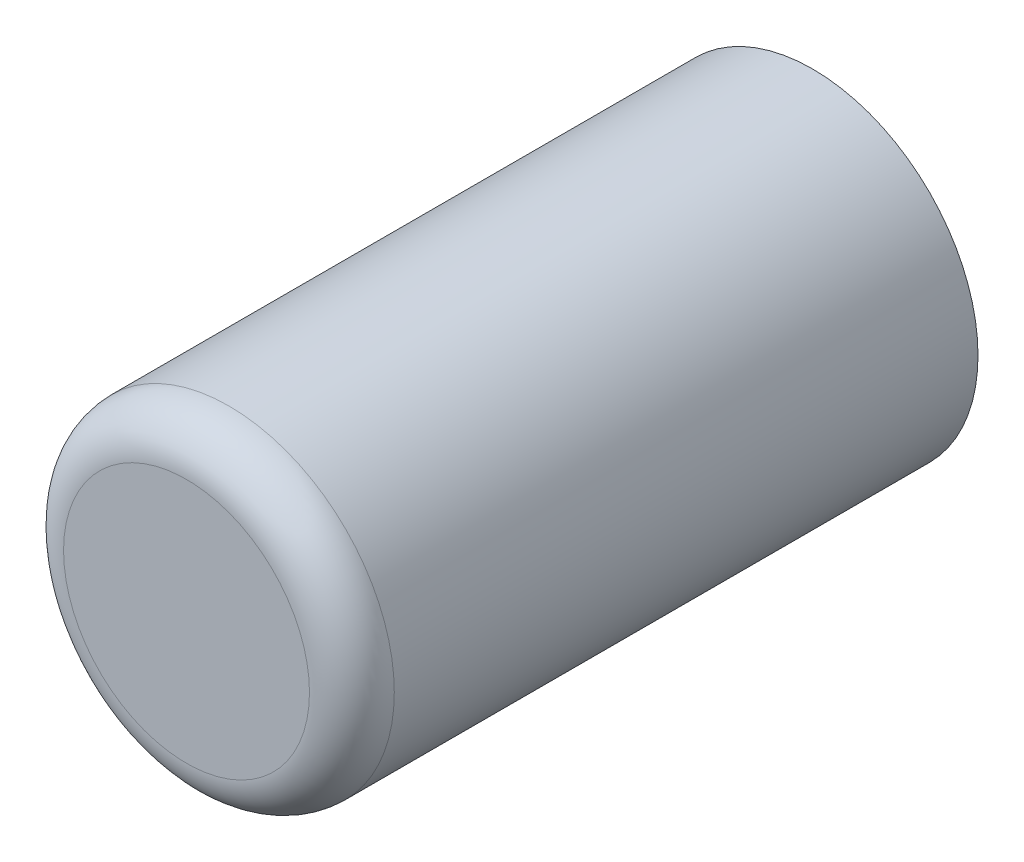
ISO-10303-21;
HEADER;
FILE_DESCRIPTION(('STEP AP214'),'2;1');
FILE_NAME('part.step','',(''),(''),'','','');
FILE_SCHEMA(('AUTOMOTIVE_DESIGN { 1 0 10303 214 1 1 1 1 }'));
ENDSEC;
DATA;
#1=APPLICATION_CONTEXT('core data for automotive mechanical design processes');
#2=APPLICATION_PROTOCOL_DEFINITION('international standard','automotive_design',2000,#1);
#3=PRODUCT_CONTEXT('',#1,'mechanical');
#4=PRODUCT('Part','Part','',(#3));
#5=PRODUCT_RELATED_PRODUCT_CATEGORY('part','',(#4));
#6=PRODUCT_DEFINITION_FORMATION('','',#4);
#7=PRODUCT_DEFINITION_CONTEXT('part definition',#1,'design');
#8=PRODUCT_DEFINITION('design','',#6,#7);
#9=PRODUCT_DEFINITION_SHAPE('','',#8);
#10=(LENGTH_UNIT() NAMED_UNIT(*) SI_UNIT(.MILLI.,.METRE.));
#11=(NAMED_UNIT(*) PLANE_ANGLE_UNIT() SI_UNIT($,.RADIAN.));
#12=(NAMED_UNIT(*) SI_UNIT($,.STERADIAN.) SOLID_ANGLE_UNIT());
#13=UNCERTAINTY_MEASURE_WITH_UNIT(LENGTH_MEASURE(1.E-05),#10,'distance_accuracy_value','');
#14=(GEOMETRIC_REPRESENTATION_CONTEXT(3) GLOBAL_UNCERTAINTY_ASSIGNED_CONTEXT((#13)) GLOBAL_UNIT_ASSIGNED_CONTEXT((#10,
#11,#12)) REPRESENTATION_CONTEXT('',''));
#15=CARTESIAN_POINT('',(0.,0.,0.));
#16=DIRECTION('',(0.,0.,1.));
#17=DIRECTION('',(1.,0.,0.));
#18=AXIS2_PLACEMENT_3D('',#15,#16,#17);
#19=CARTESIAN_POINT('',(-22.5,239.519273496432,44.2868553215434));
#20=DIRECTION('',(0.,0.,-1.));
#21=DIRECTION('',(-1.,0.,0.));
#22=AXIS2_PLACEMENT_3D('',#19,#20,#21);
#23=CYLINDRICAL_SURFACE('',#22,11.696902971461);
#24=CARTESIAN_POINT('',(-22.5,239.519273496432,41.2868553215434));
#25=DIRECTION('',(0.,0.,1.));
#26=DIRECTION('',(1.,0.,0.));
#27=AXIS2_PLACEMENT_3D('',#24,#25,#26);
#28=CIRCLE('',#27,11.696902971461);
#29=CARTESIAN_POINT('',(-10.803097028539,239.519273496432,41.2868553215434));
#30=VERTEX_POINT('',#29);
#31=EDGE_CURVE('E10',#30,#30,#28,.F.);
#32=ORIENTED_EDGE('',*,*,#31,.T.);
#33=EDGE_LOOP('',(#32));
#34=FACE_BOUND('',#33,.T.);
#35=CARTESIAN_POINT('',(-22.5,239.519273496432,0.));
#36=DIRECTION('',(0.,0.,1.));
#37=DIRECTION('',(1.,0.,0.));
#38=AXIS2_PLACEMENT_3D('',#35,#36,#37);
#39=CIRCLE('',#38,11.696902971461);
#40=CARTESIAN_POINT('',(-10.803097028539,239.519273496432,0.));
#41=VERTEX_POINT('',#40);
#42=EDGE_CURVE('E41',#41,#41,#39,.T.);
#43=ORIENTED_EDGE('',*,*,#42,.T.);
#44=EDGE_LOOP('',(#43));
#45=FACE_BOUND('',#44,.T.);
#46=ADVANCED_FACE('F30',(#34,#45),#23,.T.);
#47=CARTESIAN_POINT('',(-22.5,239.519273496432,44.2868553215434));
#48=DIRECTION('',(0.,0.,1.));
#49=DIRECTION('',(1.,0.,0.));
#50=AXIS2_PLACEMENT_3D('',#47,#48,#49);
#51=PLANE('',#50);
#52=CARTESIAN_POINT('',(-22.5,239.519273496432,44.2868553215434));
#53=DIRECTION('',(0.,0.,1.));
#54=DIRECTION('',(1.,0.,0.));
#55=AXIS2_PLACEMENT_3D('',#52,#53,#54);
#56=CIRCLE('',#55,8.69690297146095);
#57=CARTESIAN_POINT('',(-13.803097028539,239.519273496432,44.2868553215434));
#58=VERTEX_POINT('',#57);
#59=EDGE_CURVE('E37',#58,#58,#56,.T.);
#60=ORIENTED_EDGE('',*,*,#59,.T.);
#61=EDGE_LOOP('',(#60));
#62=FACE_BOUND('',#61,.T.);
#63=ADVANCED_FACE('F51',(#62),#51,.T.);
#64=CARTESIAN_POINT('',(-22.5,239.519273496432,0.));
#65=DIRECTION('',(0.,0.,1.));
#66=DIRECTION('',(1.,0.,0.));
#67=AXIS2_PLACEMENT_3D('',#64,#65,#66);
#68=PLANE('',#67);
#69=ORIENTED_EDGE('',*,*,#42,.F.);
#70=EDGE_LOOP('',(#69));
#71=FACE_BOUND('',#70,.T.);
#72=ADVANCED_FACE('F49',(#71),#68,.F.);
#73=CARTESIAN_POINT('',(-22.5,239.519273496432,41.2868553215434));
#74=DIRECTION('',(0.,0.,1.));
#75=DIRECTION('',(1.,0.,0.));
#76=AXIS2_PLACEMENT_3D('',#73,#74,#75);
#77=TOROIDAL_SURFACE('',#76,8.69690297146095,3.);
#78=ORIENTED_EDGE('',*,*,#31,.F.);
#79=EDGE_LOOP('',(#78));
#80=FACE_BOUND('',#79,.T.);
#81=ORIENTED_EDGE('',*,*,#59,.F.);
#82=EDGE_LOOP('',(#81));
#83=FACE_BOUND('',#82,.T.);
#84=ADVANCED_FACE('F32',(#80,#83),#77,.T.);
#85=CLOSED_SHELL('',(#46,#63,#72,#84));
#86=MANIFOLD_SOLID_BREP('B2',#85);
#87=ADVANCED_BREP_SHAPE_REPRESENTATION('',(#18,#86),#14);
#88=SHAPE_DEFINITION_REPRESENTATION(#9,#87);
ENDSEC;
END-ISO-10303-21;
